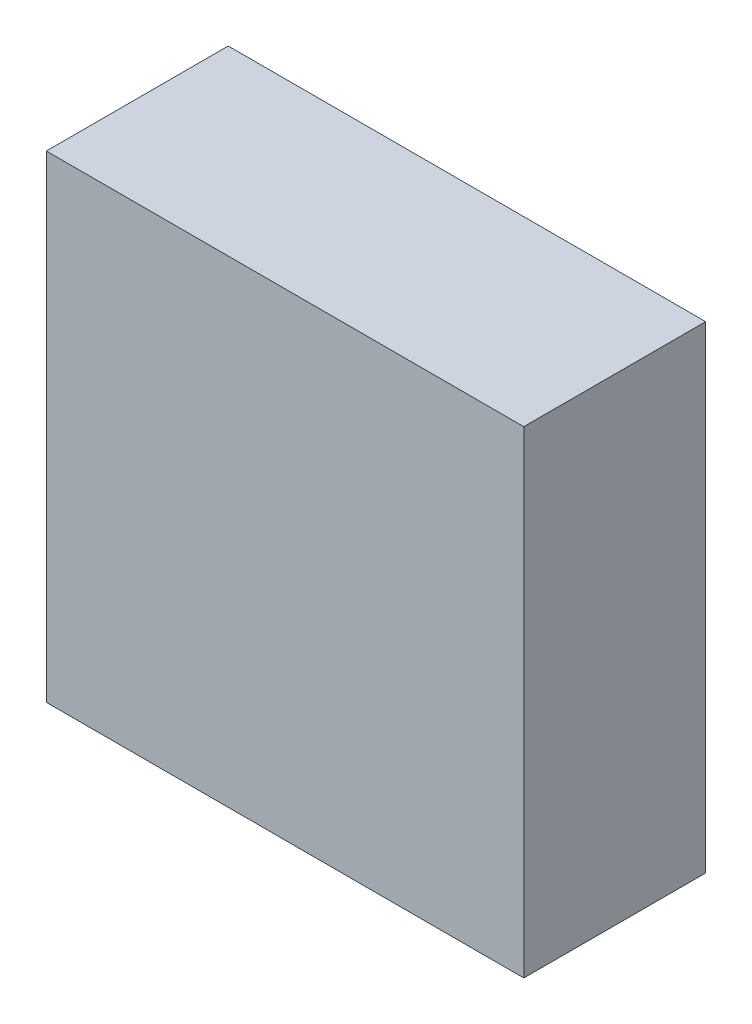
ISO-10303-21;
HEADER;
FILE_DESCRIPTION(('STEP AP214'),'2;1');
FILE_NAME('part.step','',(''),(''),'','','');
FILE_SCHEMA(('AUTOMOTIVE_DESIGN { 1 0 10303 214 1 1 1 1 }'));
ENDSEC;
DATA;
#1=APPLICATION_CONTEXT('core data for automotive mechanical design processes');
#2=APPLICATION_PROTOCOL_DEFINITION('international standard','automotive_design',2000,#1);
#3=PRODUCT_CONTEXT('',#1,'mechanical');
#4=PRODUCT('Part','Part','',(#3));
#5=PRODUCT_RELATED_PRODUCT_CATEGORY('part','',(#4));
#6=PRODUCT_DEFINITION_FORMATION('','',#4);
#7=PRODUCT_DEFINITION_CONTEXT('part definition',#1,'design');
#8=PRODUCT_DEFINITION('design','',#6,#7);
#9=PRODUCT_DEFINITION_SHAPE('','',#8);
#10=(LENGTH_UNIT() NAMED_UNIT(*) SI_UNIT(.MILLI.,.METRE.));
#11=(NAMED_UNIT(*) PLANE_ANGLE_UNIT() SI_UNIT($,.RADIAN.));
#12=(NAMED_UNIT(*) SI_UNIT($,.STERADIAN.) SOLID_ANGLE_UNIT());
#13=UNCERTAINTY_MEASURE_WITH_UNIT(LENGTH_MEASURE(1.E-05),#10,'distance_accuracy_value','');
#14=(GEOMETRIC_REPRESENTATION_CONTEXT(3) GLOBAL_UNCERTAINTY_ASSIGNED_CONTEXT((#13)) GLOBAL_UNIT_ASSIGNED_CONTEXT((#10,
#11,#12)) REPRESENTATION_CONTEXT('',''));
#15=CARTESIAN_POINT('',(0.,0.,0.));
#16=DIRECTION('',(0.,0.,1.));
#17=DIRECTION('',(1.,0.,0.));
#18=AXIS2_PLACEMENT_3D('',#15,#16,#17);
#19=CARTESIAN_POINT('',(0.,0.,0.80000094));
#20=DIRECTION('',(0.,0.,-1.));
#21=DIRECTION('',(0.,-1.,0.));
#22=AXIS2_PLACEMENT_3D('',#19,#20,#21);
#23=PLANE('',#22);
#24=DIRECTION('',(0.,1.,0.));
#25=VECTOR('',#24,1.);
#26=CARTESIAN_POINT('',(-1.05000044,-1.05000044,0.80000094));
#27=LINE('',#26,#25);
#28=CARTESIAN_POINT('',(-1.05000044,-1.05000044,0.80000094));
#29=VERTEX_POINT('',#28);
#30=CARTESIAN_POINT('',(-1.05000044,1.05000044,0.80000094));
#31=VERTEX_POINT('',#30);
#32=EDGE_CURVE('E27',#29,#31,#27,.T.);
#33=ORIENTED_EDGE('',*,*,#32,.F.);
#34=DIRECTION('',(-1.,0.,0.));
#35=VECTOR('',#34,1.);
#36=CARTESIAN_POINT('',(1.05000044,-1.05000044,0.80000094));
#37=LINE('',#36,#35);
#38=CARTESIAN_POINT('',(1.05000044,-1.05000044,0.80000094));
#39=VERTEX_POINT('',#38);
#40=EDGE_CURVE('E85',#39,#29,#37,.T.);
#41=ORIENTED_EDGE('',*,*,#40,.F.);
#42=DIRECTION('',(0.,-1.,0.));
#43=VECTOR('',#42,1.);
#44=CARTESIAN_POINT('',(1.05000044,1.05000044,0.80000094));
#45=LINE('',#44,#43);
#46=CARTESIAN_POINT('',(1.05000044,1.05000044,0.80000094));
#47=VERTEX_POINT('',#46);
#48=EDGE_CURVE('E88',#47,#39,#45,.T.);
#49=ORIENTED_EDGE('',*,*,#48,.F.);
#50=DIRECTION('',(1.,0.,0.));
#51=VECTOR('',#50,1.);
#52=CARTESIAN_POINT('',(-1.05000044,1.05000044,0.80000094));
#53=LINE('',#52,#51);
#54=EDGE_CURVE('E113',#31,#47,#53,.T.);
#55=ORIENTED_EDGE('',*,*,#54,.F.);
#56=EDGE_LOOP('',(#33,#41,#49,#55));
#57=FACE_BOUND('',#56,.T.);
#58=ADVANCED_FACE('F17',(#57),#23,.F.);
#59=CARTESIAN_POINT('',(0.,0.,0.));
#60=DIRECTION('',(0.,0.,-1.));
#61=DIRECTION('',(0.,-1.,0.));
#62=AXIS2_PLACEMENT_3D('',#59,#60,#61);
#63=PLANE('',#62);
#64=DIRECTION('',(1.,0.,0.));
#65=VECTOR('',#64,1.);
#66=CARTESIAN_POINT('',(-1.05000044,1.05000044,0.));
#67=LINE('',#66,#65);
#68=CARTESIAN_POINT('',(-1.05000044,1.05000044,0.));
#69=VERTEX_POINT('',#68);
#70=CARTESIAN_POINT('',(1.05000044,1.05000044,0.));
#71=VERTEX_POINT('',#70);
#72=EDGE_CURVE('E80',#69,#71,#67,.T.);
#73=ORIENTED_EDGE('',*,*,#72,.T.);
#74=DIRECTION('',(0.,-1.,0.));
#75=VECTOR('',#74,1.);
#76=CARTESIAN_POINT('',(1.05000044,1.05000044,0.));
#77=LINE('',#76,#75);
#78=CARTESIAN_POINT('',(1.05000044,-1.05000044,0.));
#79=VERTEX_POINT('',#78);
#80=EDGE_CURVE('E77',#71,#79,#77,.T.);
#81=ORIENTED_EDGE('',*,*,#80,.T.);
#82=DIRECTION('',(-1.,0.,0.));
#83=VECTOR('',#82,1.);
#84=CARTESIAN_POINT('',(1.05000044,-1.05000044,0.));
#85=LINE('',#84,#83);
#86=CARTESIAN_POINT('',(-1.05000044,-1.05000044,0.));
#87=VERTEX_POINT('',#86);
#88=EDGE_CURVE('E20',#79,#87,#85,.T.);
#89=ORIENTED_EDGE('',*,*,#88,.T.);
#90=DIRECTION('',(0.,1.,0.));
#91=VECTOR('',#90,1.);
#92=CARTESIAN_POINT('',(-1.05000044,-1.05000044,0.));
#93=LINE('',#92,#91);
#94=EDGE_CURVE('E11',#87,#69,#93,.T.);
#95=ORIENTED_EDGE('',*,*,#94,.T.);
#96=EDGE_LOOP('',(#73,#81,#89,#95));
#97=FACE_BOUND('',#96,.T.);
#98=ADVANCED_FACE('F78',(#97),#63,.T.);
#99=CARTESIAN_POINT('',(-1.05000044,-1.05000044,0.));
#100=DIRECTION('',(-1.,0.,0.));
#101=DIRECTION('',(0.,0.,1.));
#102=AXIS2_PLACEMENT_3D('',#99,#100,#101);
#103=PLANE('',#102);
#104=DIRECTION('',(0.,0.,1.));
#105=VECTOR('',#104,1.);
#106=CARTESIAN_POINT('',(-1.05000044,-1.05000044,0.));
#107=LINE('',#106,#105);
#108=EDGE_CURVE('E73',#87,#29,#107,.T.);
#109=ORIENTED_EDGE('',*,*,#108,.T.);
#110=ORIENTED_EDGE('',*,*,#32,.T.);
#111=DIRECTION('',(0.,0.,1.));
#112=VECTOR('',#111,1.);
#113=CARTESIAN_POINT('',(-1.05000044,1.05000044,0.));
#114=LINE('',#113,#112);
#115=EDGE_CURVE('E118',#69,#31,#114,.T.);
#116=ORIENTED_EDGE('',*,*,#115,.F.);
#117=ORIENTED_EDGE('',*,*,#94,.F.);
#118=EDGE_LOOP('',(#109,#110,#116,#117));
#119=FACE_BOUND('',#118,.T.);
#120=ADVANCED_FACE('F129',(#119),#103,.T.);
#121=CARTESIAN_POINT('',(1.05000044,-1.05000044,0.));
#122=DIRECTION('',(0.,-1.,0.));
#123=DIRECTION('',(0.,0.,-1.));
#124=AXIS2_PLACEMENT_3D('',#121,#122,#123);
#125=PLANE('',#124);
#126=DIRECTION('',(0.,0.,1.));
#127=VECTOR('',#126,1.);
#128=CARTESIAN_POINT('',(1.05000044,-1.05000044,0.));
#129=LINE('',#128,#127);
#130=EDGE_CURVE('E71',#79,#39,#129,.T.);
#131=ORIENTED_EDGE('',*,*,#130,.T.);
#132=ORIENTED_EDGE('',*,*,#40,.T.);
#133=ORIENTED_EDGE('',*,*,#108,.F.);
#134=ORIENTED_EDGE('',*,*,#88,.F.);
#135=EDGE_LOOP('',(#131,#132,#133,#134));
#136=FACE_BOUND('',#135,.T.);
#137=ADVANCED_FACE('F68',(#136),#125,.T.);
#138=CARTESIAN_POINT('',(1.05000044,1.05000044,0.));
#139=DIRECTION('',(1.,0.,0.));
#140=DIRECTION('',(0.,1.,0.));
#141=AXIS2_PLACEMENT_3D('',#138,#139,#140);
#142=PLANE('',#141);
#143=DIRECTION('',(0.,0.,1.));
#144=VECTOR('',#143,1.);
#145=CARTESIAN_POINT('',(1.05000044,1.05000044,0.));
#146=LINE('',#145,#144);
#147=EDGE_CURVE('E107',#71,#47,#146,.T.);
#148=ORIENTED_EDGE('',*,*,#147,.T.);
#149=ORIENTED_EDGE('',*,*,#48,.T.);
#150=ORIENTED_EDGE('',*,*,#130,.F.);
#151=ORIENTED_EDGE('',*,*,#80,.F.);
#152=EDGE_LOOP('',(#148,#149,#150,#151));
#153=FACE_BOUND('',#152,.T.);
#154=ADVANCED_FACE('F87',(#153),#142,.T.);
#155=CARTESIAN_POINT('',(-1.05000044,1.05000044,0.));
#156=DIRECTION('',(0.,1.,0.));
#157=DIRECTION('',(1.,0.,0.));
#158=AXIS2_PLACEMENT_3D('',#155,#156,#157);
#159=PLANE('',#158);
#160=ORIENTED_EDGE('',*,*,#115,.T.);
#161=ORIENTED_EDGE('',*,*,#54,.T.);
#162=ORIENTED_EDGE('',*,*,#147,.F.);
#163=ORIENTED_EDGE('',*,*,#72,.F.);
#164=EDGE_LOOP('',(#160,#161,#162,#163));
#165=FACE_BOUND('',#164,.T.);
#166=ADVANCED_FACE('F128',(#165),#159,.T.);
#167=CLOSED_SHELL('',(#58,#98,#120,#137,#154,#166));
#168=MANIFOLD_SOLID_BREP('B1',#167);
#169=ADVANCED_BREP_SHAPE_REPRESENTATION('',(#18,#168),#14);
#170=SHAPE_DEFINITION_REPRESENTATION(#9,#169);
ENDSEC;
END-ISO-10303-21;
